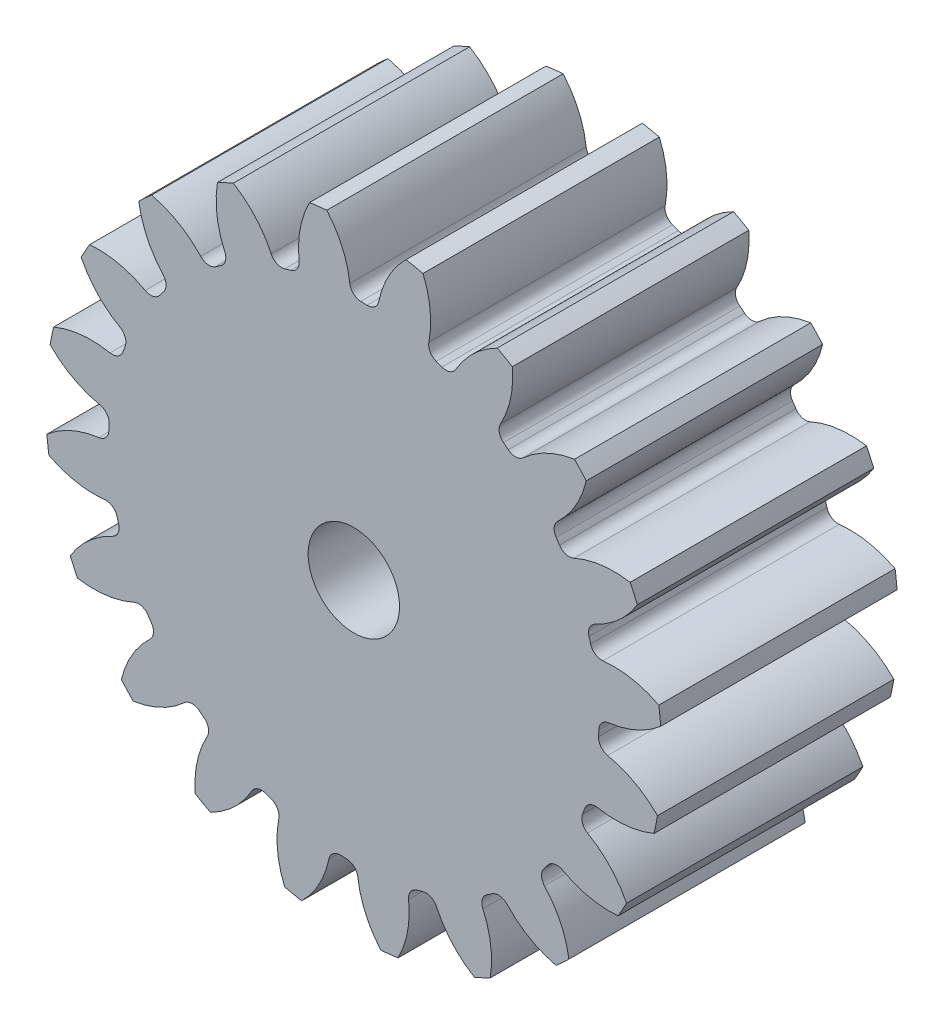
from build123d import *

# Parameters (mm, degrees)
SKETCH3_R         = 124.177777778
GEARBODY_DEPTH    = 95.25
TOOTHCUT_DEPTH    = 200.781889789
CIRPATTERN1_COUNT = 20
BOREDIA_R         = 18.415
BORE_DEPTH        = 12700


with BuildPart() as part:
    # Sketch3 → gearBody (new body)
    with BuildSketch(Plane.XY):
        Circle(SKETCH3_R)
    extrude(amount=GEARBODY_DEPTH)

    # Sketch2 → toothCut (cut, through all)
    with BuildSketch(Plane.XY):
        with BuildLine():
            ThreePointArc((98.63630656, -5.284733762), (98.694467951, -4.056029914), (98.73732408, -2.826697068))
            ThreePointArc((98.73732408, -2.826697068), (99.933629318, 0.136118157), (102.77251834, 1.602450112))
            ThreePointArc((102.77251834, 1.602450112), (114.217303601, 4.813256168), (124.177777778, 11.300269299))
            ThreePointArc((124.177777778, 11.300269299), (124.585718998, -5.120078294), (122.831780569, -21.451579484))
            ThreePointArc((122.831780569, -21.451579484), (113.437187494, -14.169134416), (102.294459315, -10.030053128))
            ThreePointArc((102.294459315, -10.030053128), (99.585463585, -8.335720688), (98.63630656, -5.284733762))
        make_face()
    toothcut = extrude(amount=TOOTHCUT_DEPTH, mode=Mode.SUBTRACT)

    # CirPattern1: toothCut ×20 about axis
    cirpattern1_axis = Axis((0, 0, 0), (0, 0, 1))
    for i in range(1, CIRPATTERN1_COUNT):
        add(toothcut.rotate(cirpattern1_axis, i * 360 / CIRPATTERN1_COUNT), mode=Mode.SUBTRACT)

    # boreDia → bore (cut, symmetric)
    with BuildSketch(Plane.XY):
        Circle(BOREDIA_R)
    extrude(amount=BORE_DEPTH, both=True, mode=Mode.SUBTRACT)


solid = part.part
